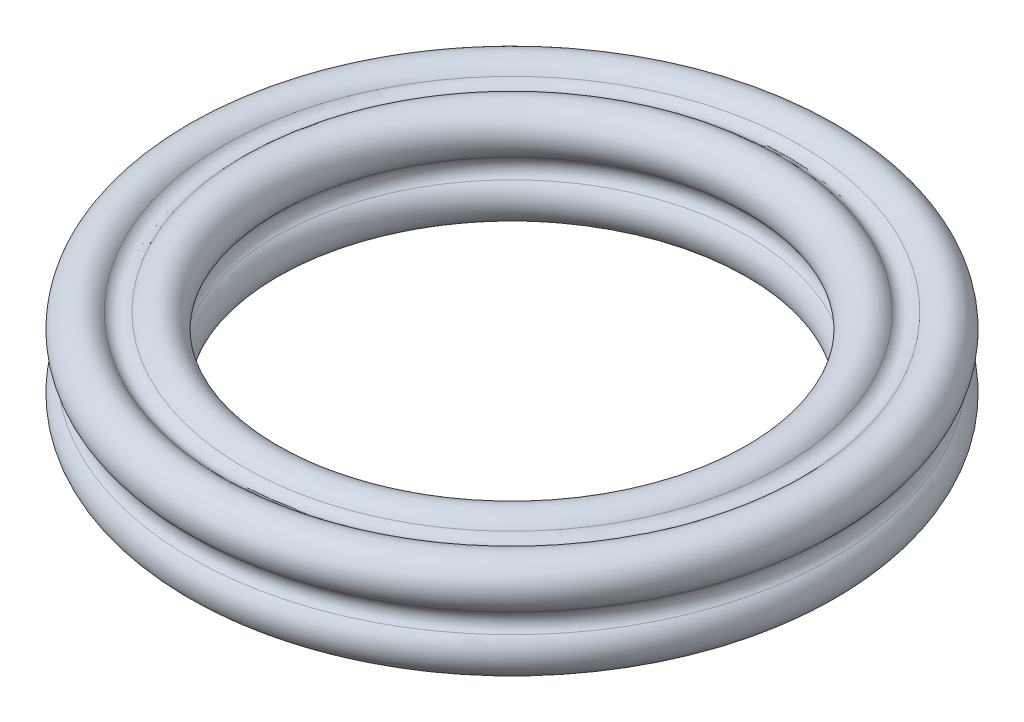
ISO-10303-21;
HEADER;
FILE_DESCRIPTION(('STEP AP214'),'2;1');
FILE_NAME('part.step','',(''),(''),'','','');
FILE_SCHEMA(('AUTOMOTIVE_DESIGN { 1 0 10303 214 1 1 1 1 }'));
ENDSEC;
DATA;
#1=APPLICATION_CONTEXT('core data for automotive mechanical design processes');
#2=APPLICATION_PROTOCOL_DEFINITION('international standard','automotive_design',2000,#1);
#3=PRODUCT_CONTEXT('',#1,'mechanical');
#4=PRODUCT('Part','Part','',(#3));
#5=PRODUCT_RELATED_PRODUCT_CATEGORY('part','',(#4));
#6=PRODUCT_DEFINITION_FORMATION('','',#4);
#7=PRODUCT_DEFINITION_CONTEXT('part definition',#1,'design');
#8=PRODUCT_DEFINITION('design','',#6,#7);
#9=PRODUCT_DEFINITION_SHAPE('','',#8);
#10=(LENGTH_UNIT() NAMED_UNIT(*) SI_UNIT(.MILLI.,.METRE.));
#11=(NAMED_UNIT(*) PLANE_ANGLE_UNIT() SI_UNIT($,.RADIAN.));
#12=(NAMED_UNIT(*) SI_UNIT($,.STERADIAN.) SOLID_ANGLE_UNIT());
#13=UNCERTAINTY_MEASURE_WITH_UNIT(LENGTH_MEASURE(1.E-05),#10,'distance_accuracy_value','');
#14=(GEOMETRIC_REPRESENTATION_CONTEXT(3) GLOBAL_UNCERTAINTY_ASSIGNED_CONTEXT((#13)) GLOBAL_UNIT_ASSIGNED_CONTEXT((#10,
#11,#12)) REPRESENTATION_CONTEXT('',''));
#15=CARTESIAN_POINT('',(0.,0.,0.));
#16=DIRECTION('',(0.,0.,1.));
#17=DIRECTION('',(1.,0.,0.));
#18=AXIS2_PLACEMENT_3D('',#15,#16,#17);
#19=CARTESIAN_POINT('',(0.,0.,0.));
#20=DIRECTION('',(0.,1.,0.));
#21=DIRECTION('',(-1.,0.,0.));
#22=AXIS2_PLACEMENT_3D('',#19,#20,#21);
#23=TOROIDAL_SURFACE('',#22,7.16,0.329569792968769);
#24=CARTESIAN_POINT('',(0.,0.212724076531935,0.));
#25=DIRECTION('',(0.,1.,0.));
#26=DIRECTION('',(-1.,0.,0.));
#27=AXIS2_PLACEMENT_3D('',#24,#25,#26);
#28=CIRCLE('',#27,6.90827650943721);
#29=CARTESIAN_POINT('',(-6.90827650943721,0.212724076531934,0.));
#30=VERTEX_POINT('',#29);
#31=EDGE_CURVE('E58',#30,#30,#28,.T.);
#32=ORIENTED_EDGE('',*,*,#31,.T.);
#33=EDGE_LOOP('',(#32));
#34=FACE_BOUND('',#33,.T.);
#35=CARTESIAN_POINT('',(0.,0.212724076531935,0.));
#36=DIRECTION('',(0.,1.,0.));
#37=DIRECTION('',(-1.,0.,0.));
#38=AXIS2_PLACEMENT_3D('',#35,#36,#37);
#39=CIRCLE('',#38,7.41172349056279);
#40=CARTESIAN_POINT('',(-7.41172349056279,0.212724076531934,0.));
#41=VERTEX_POINT('',#40);
#42=EDGE_CURVE('E10',#41,#41,#39,.T.);
#43=ORIENTED_EDGE('',*,*,#42,.F.);
#44=EDGE_LOOP('',(#43));
#45=FACE_BOUND('',#44,.T.);
#46=ADVANCED_FACE('F30',(#34,#45),#23,.F.);
#47=CARTESIAN_POINT('',(0.,0.600000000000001,0.));
#48=DIRECTION('',(0.,1.,0.));
#49=DIRECTION('',(-1.,0.,0.));
#50=AXIS2_PLACEMENT_3D('',#47,#48,#49);
#51=TOROIDAL_SURFACE('',#50,7.87,0.6);
#52=ORIENTED_EDGE('',*,*,#42,.T.);
#53=EDGE_LOOP('',(#52));
#54=FACE_BOUND('',#53,.T.);
#55=CARTESIAN_POINT('',(0.,1.05827650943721,0.));
#56=DIRECTION('',(0.,1.,0.));
#57=DIRECTION('',(-1.,0.,0.));
#58=AXIS2_PLACEMENT_3D('',#55,#56,#57);
#59=CIRCLE('',#58,8.25727592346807);
#60=CARTESIAN_POINT('',(-8.25727592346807,1.05827650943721,0.));
#61=VERTEX_POINT('',#60);
#62=EDGE_CURVE('E36',#61,#61,#59,.T.);
#63=ORIENTED_EDGE('',*,*,#62,.F.);
#64=EDGE_LOOP('',(#63));
#65=FACE_BOUND('',#64,.T.);
#66=ADVANCED_FACE('F76',(#54,#65),#51,.T.);
#67=CARTESIAN_POINT('',(0.,1.31,0.));
#68=DIRECTION('',(0.,1.,0.));
#69=DIRECTION('',(-1.,0.,0.));
#70=AXIS2_PLACEMENT_3D('',#67,#68,#69);
#71=TOROIDAL_SURFACE('',#70,8.47,0.329569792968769);
#72=ORIENTED_EDGE('',*,*,#62,.T.);
#73=EDGE_LOOP('',(#72));
#74=FACE_BOUND('',#73,.T.);
#75=CARTESIAN_POINT('',(0.,1.56172349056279,0.));
#76=DIRECTION('',(0.,1.,0.));
#77=DIRECTION('',(-1.,0.,0.));
#78=AXIS2_PLACEMENT_3D('',#75,#76,#77);
#79=CIRCLE('',#78,8.25727592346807);
#80=CARTESIAN_POINT('',(-8.25727592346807,1.56172349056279,0.));
#81=VERTEX_POINT('',#80);
#82=EDGE_CURVE('E40',#81,#81,#79,.T.);
#83=ORIENTED_EDGE('',*,*,#82,.F.);
#84=EDGE_LOOP('',(#83));
#85=FACE_BOUND('',#84,.T.);
#86=ADVANCED_FACE('F80',(#74,#85),#71,.F.);
#87=CARTESIAN_POINT('',(0.,2.02,0.));
#88=DIRECTION('',(0.,1.,0.));
#89=DIRECTION('',(-1.,0.,0.));
#90=AXIS2_PLACEMENT_3D('',#87,#88,#89);
#91=TOROIDAL_SURFACE('',#90,7.87,0.6);
#92=ORIENTED_EDGE('',*,*,#82,.T.);
#93=EDGE_LOOP('',(#92));
#94=FACE_BOUND('',#93,.T.);
#95=CARTESIAN_POINT('',(0.,2.40727592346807,0.));
#96=DIRECTION('',(0.,1.,0.));
#97=DIRECTION('',(-1.,0.,0.));
#98=AXIS2_PLACEMENT_3D('',#95,#96,#97);
#99=CIRCLE('',#98,7.41172349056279);
#100=CARTESIAN_POINT('',(-7.41172349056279,2.40727592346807,0.));
#101=VERTEX_POINT('',#100);
#102=EDGE_CURVE('E44',#101,#101,#99,.T.);
#103=ORIENTED_EDGE('',*,*,#102,.F.);
#104=EDGE_LOOP('',(#103));
#105=FACE_BOUND('',#104,.T.);
#106=ADVANCED_FACE('F84',(#94,#105),#91,.T.);
#107=CARTESIAN_POINT('',(0.,2.62,0.));
#108=DIRECTION('',(0.,1.,0.));
#109=DIRECTION('',(-1.,0.,0.));
#110=AXIS2_PLACEMENT_3D('',#107,#108,#109);
#111=TOROIDAL_SURFACE('',#110,7.16,0.329569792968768);
#112=ORIENTED_EDGE('',*,*,#102,.T.);
#113=EDGE_LOOP('',(#112));
#114=FACE_BOUND('',#113,.T.);
#115=CARTESIAN_POINT('',(0.,2.40727592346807,0.));
#116=DIRECTION('',(0.,1.,0.));
#117=DIRECTION('',(-1.,0.,0.));
#118=AXIS2_PLACEMENT_3D('',#115,#116,#117);
#119=CIRCLE('',#118,6.90827650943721);
#120=CARTESIAN_POINT('',(-6.90827650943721,2.40727592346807,0.));
#121=VERTEX_POINT('',#120);
#122=EDGE_CURVE('E49',#121,#121,#119,.T.);
#123=ORIENTED_EDGE('',*,*,#122,.F.);
#124=EDGE_LOOP('',(#123));
#125=FACE_BOUND('',#124,.T.);
#126=ADVANCED_FACE('F90',(#114,#125),#111,.F.);
#127=CARTESIAN_POINT('',(0.,2.02,0.));
#128=DIRECTION('',(0.,1.,0.));
#129=DIRECTION('',(-1.,0.,0.));
#130=AXIS2_PLACEMENT_3D('',#127,#128,#129);
#131=TOROIDAL_SURFACE('',#130,6.45,0.6);
#132=ORIENTED_EDGE('',*,*,#122,.T.);
#133=EDGE_LOOP('',(#132));
#134=FACE_BOUND('',#133,.T.);
#135=CARTESIAN_POINT('',(0.,1.56172349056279,0.));
#136=DIRECTION('',(0.,1.,0.));
#137=DIRECTION('',(-1.,0.,0.));
#138=AXIS2_PLACEMENT_3D('',#135,#136,#137);
#139=CIRCLE('',#138,6.06272407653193);
#140=CARTESIAN_POINT('',(-6.06272407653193,1.56172349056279,0.));
#141=VERTEX_POINT('',#140);
#142=EDGE_CURVE('E52',#141,#141,#139,.T.);
#143=ORIENTED_EDGE('',*,*,#142,.F.);
#144=EDGE_LOOP('',(#143));
#145=FACE_BOUND('',#144,.T.);
#146=ADVANCED_FACE('F72',(#134,#145),#131,.T.);
#147=CARTESIAN_POINT('',(0.,1.31,0.));
#148=DIRECTION('',(0.,1.,0.));
#149=DIRECTION('',(-1.,0.,0.));
#150=AXIS2_PLACEMENT_3D('',#147,#148,#149);
#151=TOROIDAL_SURFACE('',#150,5.85,0.329569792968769);
#152=ORIENTED_EDGE('',*,*,#142,.T.);
#153=EDGE_LOOP('',(#152));
#154=FACE_BOUND('',#153,.T.);
#155=CARTESIAN_POINT('',(0.,1.05827650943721,0.));
#156=DIRECTION('',(0.,1.,0.));
#157=DIRECTION('',(-1.,0.,0.));
#158=AXIS2_PLACEMENT_3D('',#155,#156,#157);
#159=CIRCLE('',#158,6.06272407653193);
#160=CARTESIAN_POINT('',(-6.06272407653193,1.05827650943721,0.));
#161=VERTEX_POINT('',#160);
#162=EDGE_CURVE('E55',#161,#161,#159,.T.);
#163=ORIENTED_EDGE('',*,*,#162,.F.);
#164=EDGE_LOOP('',(#163));
#165=FACE_BOUND('',#164,.T.);
#166=ADVANCED_FACE('F66',(#154,#165),#151,.F.);
#167=CARTESIAN_POINT('',(0.,0.600000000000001,0.));
#168=DIRECTION('',(0.,1.,0.));
#169=DIRECTION('',(-1.,0.,0.));
#170=AXIS2_PLACEMENT_3D('',#167,#168,#169);
#171=TOROIDAL_SURFACE('',#170,6.45,0.6);
#172=ORIENTED_EDGE('',*,*,#162,.T.);
#173=EDGE_LOOP('',(#172));
#174=FACE_BOUND('',#173,.T.);
#175=ORIENTED_EDGE('',*,*,#31,.F.);
#176=EDGE_LOOP('',(#175));
#177=FACE_BOUND('',#176,.T.);
#178=ADVANCED_FACE('F64',(#174,#177),#171,.T.);
#179=CLOSED_SHELL('',(#46,#66,#86,#106,#126,#146,#166,#178));
#180=MANIFOLD_SOLID_BREP('B2',#179);
#181=ADVANCED_BREP_SHAPE_REPRESENTATION('',(#18,#180),#14);
#182=SHAPE_DEFINITION_REPRESENTATION(#9,#181);
ENDSEC;
END-ISO-10303-21;
